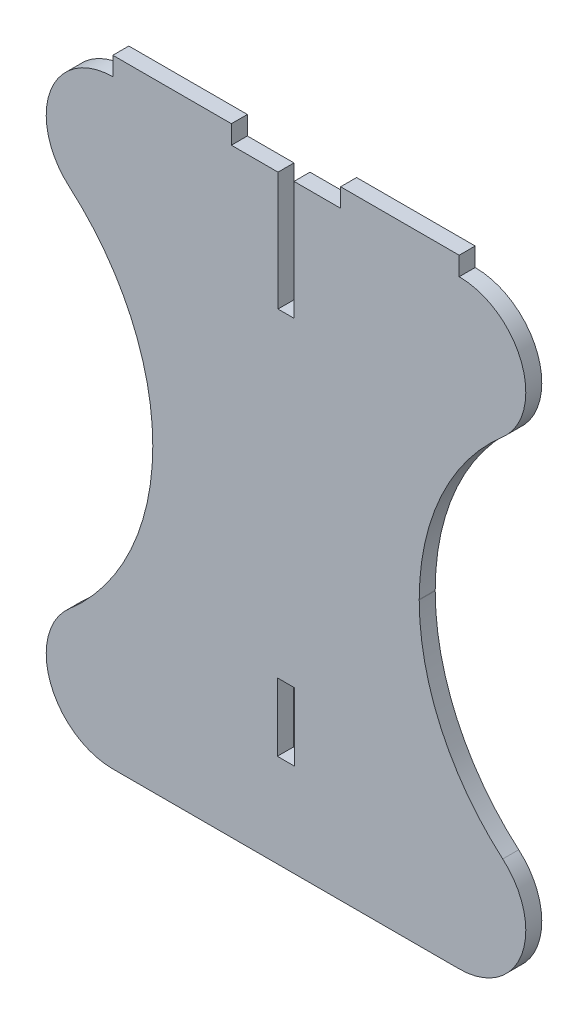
ISO-10303-21;
HEADER;
FILE_DESCRIPTION(('STEP AP214'),'2;1');
FILE_NAME('part.step','',(''),(''),'','','');
FILE_SCHEMA(('AUTOMOTIVE_DESIGN { 1 0 10303 214 1 1 1 1 }'));
ENDSEC;
DATA;
#1=APPLICATION_CONTEXT('core data for automotive mechanical design processes');
#2=APPLICATION_PROTOCOL_DEFINITION('international standard','automotive_design',2000,#1);
#3=PRODUCT_CONTEXT('',#1,'mechanical');
#4=PRODUCT('Part','Part','',(#3));
#5=PRODUCT_RELATED_PRODUCT_CATEGORY('part','',(#4));
#6=PRODUCT_DEFINITION_FORMATION('','',#4);
#7=PRODUCT_DEFINITION_CONTEXT('part definition',#1,'design');
#8=PRODUCT_DEFINITION('design','',#6,#7);
#9=PRODUCT_DEFINITION_SHAPE('','',#8);
#10=(LENGTH_UNIT() NAMED_UNIT(*) SI_UNIT(.MILLI.,.METRE.));
#11=(NAMED_UNIT(*) PLANE_ANGLE_UNIT() SI_UNIT($,.RADIAN.));
#12=(NAMED_UNIT(*) SI_UNIT($,.STERADIAN.) SOLID_ANGLE_UNIT());
#13=UNCERTAINTY_MEASURE_WITH_UNIT(LENGTH_MEASURE(1.E-05),#10,'distance_accuracy_value','');
#14=(GEOMETRIC_REPRESENTATION_CONTEXT(3) GLOBAL_UNCERTAINTY_ASSIGNED_CONTEXT((#13)) GLOBAL_UNIT_ASSIGNED_CONTEXT((#10,
#11,#12)) REPRESENTATION_CONTEXT('',''));
#15=CARTESIAN_POINT('',(0.,0.,0.));
#16=DIRECTION('',(0.,0.,1.));
#17=DIRECTION('',(1.,0.,0.));
#18=AXIS2_PLACEMENT_3D('',#15,#16,#17);
#19=CARTESIAN_POINT('',(50.0000000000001,450.,12.));
#20=DIRECTION('',(0.,-1.,0.));
#21=DIRECTION('',(1.,0.,0.));
#22=AXIS2_PLACEMENT_3D('',#19,#20,#21);
#23=PLANE('',#22);
#24=DIRECTION('',(-1.,0.,0.));
#25=VECTOR('',#24,1.);
#26=CARTESIAN_POINT('',(50.0000000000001,450.,0.));
#27=LINE('',#26,#25);
#28=CARTESIAN_POINT('',(221.000000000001,450.000000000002,0.));
#29=VERTEX_POINT('',#28);
#30=CARTESIAN_POINT('',(186.,450.000000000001,0.));
#31=VERTEX_POINT('',#30);
#32=EDGE_CURVE('E357',#29,#31,#27,.T.);
#33=ORIENTED_EDGE('',*,*,#32,.T.);
#34=DIRECTION('',(0.,0.,1.));
#35=VECTOR('',#34,1.);
#36=CARTESIAN_POINT('',(186.,450.000000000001,0.));
#37=LINE('',#36,#35);
#38=CARTESIAN_POINT('',(186.,450.000000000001,12.));
#39=VERTEX_POINT('',#38);
#40=EDGE_CURVE('E259',#31,#39,#37,.T.);
#41=ORIENTED_EDGE('',*,*,#40,.T.);
#42=DIRECTION('',(-1.,0.,0.));
#43=VECTOR('',#42,1.);
#44=CARTESIAN_POINT('',(50.0000000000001,450.,12.));
#45=LINE('',#44,#43);
#46=CARTESIAN_POINT('',(221.000000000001,450.000000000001,12.));
#47=VERTEX_POINT('',#46);
#48=EDGE_CURVE('E335',#47,#39,#45,.T.);
#49=ORIENTED_EDGE('',*,*,#48,.F.);
#50=DIRECTION('',(0.,0.,1.));
#51=VECTOR('',#50,1.);
#52=CARTESIAN_POINT('',(221.000000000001,450.000000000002,0.));
#53=LINE('',#52,#51);
#54=EDGE_CURVE('E286',#29,#47,#53,.T.);
#55=ORIENTED_EDGE('',*,*,#54,.F.);
#56=EDGE_LOOP('',(#33,#41,#49,#55));
#57=FACE_BOUND('',#56,.T.);
#58=ADVANCED_FACE('F33',(#57),#23,.F.);
#59=CARTESIAN_POINT('',(80.0000000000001,350.,12.));
#60=DIRECTION('',(1.,0.,0.));
#61=DIRECTION('',(0.,1.,0.));
#62=AXIS2_PLACEMENT_3D('',#59,#60,#61);
#63=PLANE('',#62);
#64=DIRECTION('',(0.,-1.,0.));
#65=VECTOR('',#64,1.);
#66=CARTESIAN_POINT('',(80.0000000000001,350.,0.));
#67=LINE('',#66,#65);
#68=CARTESIAN_POINT('',(80.0000000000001,225.185812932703,0.));
#69=VERTEX_POINT('',#68);
#70=CARTESIAN_POINT('',(80.0000000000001,224.81418706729,0.));
#71=VERTEX_POINT('',#70);
#72=EDGE_CURVE('E313',#69,#71,#67,.T.);
#73=ORIENTED_EDGE('',*,*,#72,.T.);
#74=DIRECTION('',(0.,0.,1.));
#75=VECTOR('',#74,1.);
#76=CARTESIAN_POINT('',(80.0000000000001,224.81418706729,12.));
#77=LINE('',#76,#75);
#78=CARTESIAN_POINT('',(80.0000000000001,224.81418706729,12.));
#79=VERTEX_POINT('',#78);
#80=EDGE_CURVE('E379',#71,#79,#77,.T.);
#81=ORIENTED_EDGE('',*,*,#80,.T.);
#82=DIRECTION('',(0.,-1.,0.));
#83=VECTOR('',#82,1.);
#84=CARTESIAN_POINT('',(80.0000000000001,350.,12.));
#85=LINE('',#84,#83);
#86=CARTESIAN_POINT('',(80.0000000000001,225.185812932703,12.));
#87=VERTEX_POINT('',#86);
#88=EDGE_CURVE('E318',#87,#79,#85,.T.);
#89=ORIENTED_EDGE('',*,*,#88,.F.);
#90=DIRECTION('',(0.,0.,1.));
#91=VECTOR('',#90,1.);
#92=CARTESIAN_POINT('',(80.0000000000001,225.185812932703,0.));
#93=LINE('',#92,#91);
#94=EDGE_CURVE('E376',#87,#69,#93,.F.);
#95=ORIENTED_EDGE('',*,*,#94,.T.);
#96=EDGE_LOOP('',(#73,#81,#89,#95));
#97=FACE_BOUND('',#96,.T.);
#98=ADVANCED_FACE('F419',(#97),#63,.F.);
#99=CARTESIAN_POINT('',(50.0000000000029,49.999999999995,12.));
#100=DIRECTION('',(0.,0.,-1.));
#101=DIRECTION('',(-1.,0.,0.));
#102=AXIS2_PLACEMENT_3D('',#99,#100,#101);
#103=CYLINDRICAL_SURFACE('',#102,50.);
#104=CARTESIAN_POINT('',(50.0000000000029,49.999999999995,12.));
#105=DIRECTION('',(0.,0.,1.));
#106=DIRECTION('',(-1.,0.,0.));
#107=AXIS2_PLACEMENT_3D('',#104,#105,#106);
#108=CIRCLE('',#107,50.);
#109=CARTESIAN_POINT('',(17.3160173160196,87.8385686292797,12.));
#110=VERTEX_POINT('',#109);
#111=CARTESIAN_POINT('',(50.0000000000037,-4.96824803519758E-12,12.));
#112=VERTEX_POINT('',#111);
#113=EDGE_CURVE('E321',#110,#112,#108,.T.);
#114=ORIENTED_EDGE('',*,*,#113,.F.);
#115=DIRECTION('',(0.,0.,-1.));
#116=VECTOR('',#115,1.);
#117=CARTESIAN_POINT('',(17.3160173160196,87.8385686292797,12.));
#118=LINE('',#117,#116);
#119=CARTESIAN_POINT('',(17.3160173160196,87.8385686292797,0.));
#120=VERTEX_POINT('',#119);
#121=EDGE_CURVE('E373',#110,#120,#118,.T.);
#122=ORIENTED_EDGE('',*,*,#121,.T.);
#123=CARTESIAN_POINT('',(50.0000000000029,49.999999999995,0.));
#124=DIRECTION('',(0.,0.,1.));
#125=DIRECTION('',(-1.,0.,0.));
#126=AXIS2_PLACEMENT_3D('',#123,#124,#125);
#127=CIRCLE('',#126,50.);
#128=CARTESIAN_POINT('',(50.0000000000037,-4.96824803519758E-12,0.));
#129=VERTEX_POINT('',#128);
#130=EDGE_CURVE('E344',#120,#129,#127,.T.);
#131=ORIENTED_EDGE('',*,*,#130,.T.);
#132=DIRECTION('',(0.,0.,-1.));
#133=VECTOR('',#132,1.);
#134=CARTESIAN_POINT('',(50.0000000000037,-4.96824803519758E-12,12.));
#135=LINE('',#134,#133);
#136=EDGE_CURVE('E370',#112,#129,#135,.T.);
#137=ORIENTED_EDGE('',*,*,#136,.F.);
#138=EDGE_LOOP('',(#114,#122,#131,#137));
#139=FACE_BOUND('',#138,.T.);
#140=ADVANCED_FACE('F427',(#139),#103,.T.);
#141=CARTESIAN_POINT('',(310.000000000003,-2.77555756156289E-12,12.));
#142=DIRECTION('',(0.,1.,0.));
#143=DIRECTION('',(-1.,0.,0.));
#144=AXIS2_PLACEMENT_3D('',#141,#142,#143);
#145=PLANE('',#144);
#146=DIRECTION('',(1.,0.,0.));
#147=VECTOR('',#146,1.);
#148=CARTESIAN_POINT('',(310.000000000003,-2.77555756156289E-12,0.));
#149=LINE('',#148,#147);
#150=CARTESIAN_POINT('',(310.000000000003,-2.77555756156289E-12,0.));
#151=VERTEX_POINT('',#150);
#152=EDGE_CURVE('E346',#129,#151,#149,.T.);
#153=ORIENTED_EDGE('',*,*,#152,.T.);
#154=DIRECTION('',(0.,0.,-1.));
#155=VECTOR('',#154,1.);
#156=CARTESIAN_POINT('',(310.000000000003,-2.77555756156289E-12,12.));
#157=LINE('',#156,#155);
#158=CARTESIAN_POINT('',(310.000000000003,-2.77555756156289E-12,12.));
#159=VERTEX_POINT('',#158);
#160=EDGE_CURVE('E367',#159,#151,#157,.T.);
#161=ORIENTED_EDGE('',*,*,#160,.F.);
#162=DIRECTION('',(1.,0.,0.));
#163=VECTOR('',#162,1.);
#164=CARTESIAN_POINT('',(310.000000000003,-2.77555756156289E-12,12.));
#165=LINE('',#164,#163);
#166=EDGE_CURVE('E324',#112,#159,#165,.T.);
#167=ORIENTED_EDGE('',*,*,#166,.F.);
#168=ORIENTED_EDGE('',*,*,#136,.T.);
#169=EDGE_LOOP('',(#153,#161,#167,#168));
#170=FACE_BOUND('',#169,.T.);
#171=ADVANCED_FACE('F433',(#170),#145,.F.);
#172=CARTESIAN_POINT('',(310.000000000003,49.9999999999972,12.));
#173=DIRECTION('',(0.,0.,-1.));
#174=DIRECTION('',(-1.,0.,0.));
#175=AXIS2_PLACEMENT_3D('',#172,#173,#174);
#176=CYLINDRICAL_SURFACE('',#175,50.);
#177=CARTESIAN_POINT('',(310.000000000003,49.9999999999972,0.));
#178=DIRECTION('',(0.,0.,1.));
#179=DIRECTION('',(1.,0.,0.));
#180=AXIS2_PLACEMENT_3D('',#177,#178,#179);
#181=CIRCLE('',#180,50.);
#182=CARTESIAN_POINT('',(342.683982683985,87.838568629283,0.));
#183=VERTEX_POINT('',#182);
#184=EDGE_CURVE('E348',#151,#183,#181,.T.);
#185=ORIENTED_EDGE('',*,*,#184,.T.);
#186=DIRECTION('',(0.,0.,-1.));
#187=VECTOR('',#186,1.);
#188=CARTESIAN_POINT('',(342.683982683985,87.8385686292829,12.));
#189=LINE('',#188,#187);
#190=CARTESIAN_POINT('',(342.683982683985,87.838568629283,12.));
#191=VERTEX_POINT('',#190);
#192=EDGE_CURVE('E386',#183,#191,#189,.F.);
#193=ORIENTED_EDGE('',*,*,#192,.T.);
#194=CARTESIAN_POINT('',(310.000000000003,49.9999999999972,12.));
#195=DIRECTION('',(0.,0.,1.));
#196=DIRECTION('',(1.,0.,0.));
#197=AXIS2_PLACEMENT_3D('',#194,#195,#196);
#198=CIRCLE('',#197,50.);
#199=EDGE_CURVE('E326',#159,#191,#198,.T.);
#200=ORIENTED_EDGE('',*,*,#199,.F.);
#201=ORIENTED_EDGE('',*,*,#160,.T.);
#202=EDGE_LOOP('',(#185,#193,#200,#201));
#203=FACE_BOUND('',#202,.T.);
#204=ADVANCED_FACE('F521',(#203),#176,.T.);
#205=CARTESIAN_POINT('',(280.,350.,12.));
#206=DIRECTION('',(-1.,0.,0.));
#207=DIRECTION('',(0.,0.,1.));
#208=AXIS2_PLACEMENT_3D('',#205,#206,#207);
#209=PLANE('',#208);
#210=DIRECTION('',(0.,1.,0.));
#211=VECTOR('',#210,1.);
#212=CARTESIAN_POINT('',(280.,350.,12.));
#213=LINE('',#212,#211);
#214=CARTESIAN_POINT('',(280.,224.814187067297,12.));
#215=VERTEX_POINT('',#214);
#216=CARTESIAN_POINT('',(280.,225.185812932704,12.));
#217=VERTEX_POINT('',#216);
#218=EDGE_CURVE('E329',#215,#217,#213,.T.);
#219=ORIENTED_EDGE('',*,*,#218,.F.);
#220=DIRECTION('',(0.,0.,1.));
#221=VECTOR('',#220,1.);
#222=CARTESIAN_POINT('',(280.,224.814187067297,0.));
#223=LINE('',#222,#221);
#224=CARTESIAN_POINT('',(280.,224.814187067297,0.));
#225=VERTEX_POINT('',#224);
#226=EDGE_CURVE('E383',#215,#225,#223,.F.);
#227=ORIENTED_EDGE('',*,*,#226,.T.);
#228=DIRECTION('',(0.,1.,0.));
#229=VECTOR('',#228,1.);
#230=CARTESIAN_POINT('',(280.,350.,0.));
#231=LINE('',#230,#229);
#232=CARTESIAN_POINT('',(280.,225.185812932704,0.));
#233=VERTEX_POINT('',#232);
#234=EDGE_CURVE('E351',#225,#233,#231,.T.);
#235=ORIENTED_EDGE('',*,*,#234,.T.);
#236=DIRECTION('',(0.,0.,1.));
#237=VECTOR('',#236,1.);
#238=CARTESIAN_POINT('',(280.,225.185812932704,12.));
#239=LINE('',#238,#237);
#240=EDGE_CURVE('E381',#233,#217,#239,.T.);
#241=ORIENTED_EDGE('',*,*,#240,.T.);
#242=EDGE_LOOP('',(#219,#227,#235,#241));
#243=FACE_BOUND('',#242,.T.);
#244=ADVANCED_FACE('F444',(#243),#209,.F.);
#245=CARTESIAN_POINT('',(310.000000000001,400.000000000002,12.));
#246=DIRECTION('',(0.,0.,-1.));
#247=DIRECTION('',(-1.,0.,0.));
#248=AXIS2_PLACEMENT_3D('',#245,#246,#247);
#249=CYLINDRICAL_SURFACE('',#248,50.);
#250=CARTESIAN_POINT('',(310.000000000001,400.000000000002,12.));
#251=DIRECTION('',(0.,0.,1.));
#252=DIRECTION('',(-1.,0.,0.));
#253=AXIS2_PLACEMENT_3D('',#250,#251,#252);
#254=CIRCLE('',#253,50.);
#255=CARTESIAN_POINT('',(342.683982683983,362.161431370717,12.));
#256=VERTEX_POINT('',#255);
#257=CARTESIAN_POINT('',(310.,450.000000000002,12.));
#258=VERTEX_POINT('',#257);
#259=EDGE_CURVE('E332',#256,#258,#254,.T.);
#260=ORIENTED_EDGE('',*,*,#259,.F.);
#261=DIRECTION('',(0.,0.,-1.));
#262=VECTOR('',#261,1.);
#263=CARTESIAN_POINT('',(342.683982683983,362.161431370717,12.));
#264=LINE('',#263,#262);
#265=CARTESIAN_POINT('',(342.683982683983,362.161431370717,0.));
#266=VERTEX_POINT('',#265);
#267=EDGE_CURVE('E388',#256,#266,#264,.T.);
#268=ORIENTED_EDGE('',*,*,#267,.T.);
#269=CARTESIAN_POINT('',(310.000000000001,400.000000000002,0.));
#270=DIRECTION('',(0.,0.,1.));
#271=DIRECTION('',(-1.,0.,0.));
#272=AXIS2_PLACEMENT_3D('',#269,#270,#271);
#273=CIRCLE('',#272,50.);
#274=CARTESIAN_POINT('',(310.,450.000000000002,0.));
#275=VERTEX_POINT('',#274);
#276=EDGE_CURVE('E354',#266,#275,#273,.T.);
#277=ORIENTED_EDGE('',*,*,#276,.T.);
#278=DIRECTION('',(0.,0.,-1.));
#279=VECTOR('',#278,1.);
#280=CARTESIAN_POINT('',(310.,450.000000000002,12.));
#281=LINE('',#280,#279);
#282=EDGE_CURVE('E364',#258,#275,#281,.T.);
#283=ORIENTED_EDGE('',*,*,#282,.F.);
#284=EDGE_LOOP('',(#260,#268,#277,#283));
#285=FACE_BOUND('',#284,.T.);
#286=ADVANCED_FACE('F455',(#285),#249,.T.);
#287=CARTESIAN_POINT('',(174.,450.000000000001,12.));
#288=VERTEX_POINT('',#287);
#289=CARTESIAN_POINT('',(139.,450.000000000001,12.));
#290=VERTEX_POINT('',#289);
#291=EDGE_CURVE('E334',#288,#290,#45,.T.);
#292=ORIENTED_EDGE('',*,*,#291,.F.);
#293=DIRECTION('',(0.,0.,1.));
#294=VECTOR('',#293,1.);
#295=CARTESIAN_POINT('',(174.,450.000000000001,0.));
#296=LINE('',#295,#294);
#297=CARTESIAN_POINT('',(174.,450.000000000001,0.));
#298=VERTEX_POINT('',#297);
#299=EDGE_CURVE('E252',#298,#288,#296,.T.);
#300=ORIENTED_EDGE('',*,*,#299,.F.);
#301=CARTESIAN_POINT('',(139.,450.000000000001,0.));
#302=VERTEX_POINT('',#301);
#303=EDGE_CURVE('E356',#298,#302,#27,.T.);
#304=ORIENTED_EDGE('',*,*,#303,.T.);
#305=DIRECTION('',(0.,0.,1.));
#306=VECTOR('',#305,1.);
#307=CARTESIAN_POINT('',(139.,450.000000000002,0.));
#308=LINE('',#307,#306);
#309=EDGE_CURVE('E303',#302,#290,#308,.T.);
#310=ORIENTED_EDGE('',*,*,#309,.T.);
#311=EDGE_LOOP('',(#292,#300,#304,#310));
#312=FACE_BOUND('',#311,.T.);
#313=ADVANCED_FACE('F484',(#312),#23,.F.);
#314=CARTESIAN_POINT('',(50.0000000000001,400.,12.));
#315=DIRECTION('',(0.,0.,-1.));
#316=DIRECTION('',(-1.,0.,0.));
#317=AXIS2_PLACEMENT_3D('',#314,#315,#316);
#318=CYLINDRICAL_SURFACE('',#317,50.);
#319=CARTESIAN_POINT('',(50.0000000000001,400.,0.));
#320=DIRECTION('',(0.,0.,1.));
#321=DIRECTION('',(1.,0.,0.));
#322=AXIS2_PLACEMENT_3D('',#319,#320,#321);
#323=CIRCLE('',#322,50.);
#324=CARTESIAN_POINT('',(50.0000000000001,450.,0.));
#325=VERTEX_POINT('',#324);
#326=CARTESIAN_POINT('',(17.3160173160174,362.161431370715,0.));
#327=VERTEX_POINT('',#326);
#328=EDGE_CURVE('E322',#325,#327,#323,.T.);
#329=ORIENTED_EDGE('',*,*,#328,.T.);
#330=DIRECTION('',(0.,0.,-1.));
#331=VECTOR('',#330,1.);
#332=CARTESIAN_POINT('',(17.3160173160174,362.161431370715,12.));
#333=LINE('',#332,#331);
#334=CARTESIAN_POINT('',(17.3160173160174,362.161431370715,12.));
#335=VERTEX_POINT('',#334);
#336=EDGE_CURVE('E391',#327,#335,#333,.F.);
#337=ORIENTED_EDGE('',*,*,#336,.T.);
#338=CARTESIAN_POINT('',(50.0000000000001,400.,12.));
#339=DIRECTION('',(0.,0.,1.));
#340=DIRECTION('',(1.,0.,0.));
#341=AXIS2_PLACEMENT_3D('',#338,#339,#340);
#342=CIRCLE('',#341,50.);
#343=CARTESIAN_POINT('',(50.0000000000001,450.,12.));
#344=VERTEX_POINT('',#343);
#345=EDGE_CURVE('E338',#344,#335,#342,.T.);
#346=ORIENTED_EDGE('',*,*,#345,.F.);
#347=DIRECTION('',(0.,0.,-1.));
#348=VECTOR('',#347,1.);
#349=CARTESIAN_POINT('',(50.0000000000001,450.,12.));
#350=LINE('',#349,#348);
#351=EDGE_CURVE('E341',#344,#325,#350,.T.);
#352=ORIENTED_EDGE('',*,*,#351,.T.);
#353=EDGE_LOOP('',(#329,#337,#346,#352));
#354=FACE_BOUND('',#353,.T.);
#355=ADVANCED_FACE('F410',(#354),#318,.T.);
#356=CARTESIAN_POINT('',(50.0000000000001,400.,12.));
#357=DIRECTION('',(0.,0.,1.));
#358=DIRECTION('',(1.,0.,0.));
#359=AXIS2_PLACEMENT_3D('',#356,#357,#358);
#360=PLANE('',#359);
#361=DIRECTION('',(0.,-1.,0.));
#362=VECTOR('',#361,1.);
#363=CARTESIAN_POINT('',(173.5,70.,12.));
#364=LINE('',#363,#362);
#365=CARTESIAN_POINT('',(173.5,121.,12.));
#366=VERTEX_POINT('',#365);
#367=CARTESIAN_POINT('',(173.5,70.0000000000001,12.));
#368=VERTEX_POINT('',#367);
#369=EDGE_CURVE('E48',#366,#368,#364,.T.);
#370=ORIENTED_EDGE('',*,*,#369,.F.);
#371=DIRECTION('',(-1.,0.,0.));
#372=VECTOR('',#371,1.);
#373=CARTESIAN_POINT('',(173.5,121.,12.));
#374=LINE('',#373,#372);
#375=CARTESIAN_POINT('',(186.5,121.,12.));
#376=VERTEX_POINT('',#375);
#377=EDGE_CURVE('E223',#376,#366,#374,.T.);
#378=ORIENTED_EDGE('',*,*,#377,.F.);
#379=DIRECTION('',(0.,1.,0.));
#380=VECTOR('',#379,1.);
#381=CARTESIAN_POINT('',(186.5,121.,12.));
#382=LINE('',#381,#380);
#383=CARTESIAN_POINT('',(186.5,70.,12.));
#384=VERTEX_POINT('',#383);
#385=EDGE_CURVE('E226',#384,#376,#382,.T.);
#386=ORIENTED_EDGE('',*,*,#385,.F.);
#387=DIRECTION('',(1.,0.,0.));
#388=VECTOR('',#387,1.);
#389=CARTESIAN_POINT('',(186.5,70.,12.));
#390=LINE('',#389,#388);
#391=EDGE_CURVE('E232',#368,#384,#390,.T.);
#392=ORIENTED_EDGE('',*,*,#391,.F.);
#393=EDGE_LOOP('',(#370,#378,#386,#392));
#394=FACE_BOUND('',#393,.T.);
#395=DIRECTION('',(0.,1.,0.));
#396=VECTOR('',#395,1.);
#397=CARTESIAN_POINT('',(186.,361.000000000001,12.));
#398=LINE('',#397,#396);
#399=CARTESIAN_POINT('',(186.,361.000000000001,12.));
#400=VERTEX_POINT('',#399);
#401=EDGE_CURVE('E246',#400,#39,#398,.T.);
#402=ORIENTED_EDGE('',*,*,#401,.F.);
#403=DIRECTION('',(1.,0.,0.));
#404=VECTOR('',#403,1.);
#405=CARTESIAN_POINT('',(174.,361.000000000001,12.));
#406=LINE('',#405,#404);
#407=CARTESIAN_POINT('',(174.,361.000000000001,12.));
#408=VERTEX_POINT('',#407);
#409=EDGE_CURVE('E255',#408,#400,#406,.T.);
#410=ORIENTED_EDGE('',*,*,#409,.F.);
#411=DIRECTION('',(0.,-1.,0.));
#412=VECTOR('',#411,1.);
#413=CARTESIAN_POINT('',(174.,450.000000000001,12.));
#414=LINE('',#413,#412);
#415=EDGE_CURVE('E238',#288,#408,#414,.T.);
#416=ORIENTED_EDGE('',*,*,#415,.F.);
#417=ORIENTED_EDGE('',*,*,#291,.T.);
#418=DIRECTION('',(0.,1.,0.));
#419=VECTOR('',#418,1.);
#420=CARTESIAN_POINT('',(139.,464.000000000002,12.));
#421=LINE('',#420,#419);
#422=CARTESIAN_POINT('',(139.,464.000000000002,12.));
#423=VERTEX_POINT('',#422);
#424=EDGE_CURVE('E289',#290,#423,#421,.T.);
#425=ORIENTED_EDGE('',*,*,#424,.T.);
#426=DIRECTION('',(-1.,0.,0.));
#427=VECTOR('',#426,1.);
#428=CARTESIAN_POINT('',(50.0000000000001,464.000000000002,12.));
#429=LINE('',#428,#427);
#430=CARTESIAN_POINT('',(50.0000000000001,464.000000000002,12.));
#431=VERTEX_POINT('',#430);
#432=EDGE_CURVE('E306',#423,#431,#429,.T.);
#433=ORIENTED_EDGE('',*,*,#432,.T.);
#434=DIRECTION('',(0.,-1.,0.));
#435=VECTOR('',#434,1.);
#436=CARTESIAN_POINT('',(50.0000000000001,450.,12.));
#437=LINE('',#436,#435);
#438=EDGE_CURVE('E297',#431,#344,#437,.T.);
#439=ORIENTED_EDGE('',*,*,#438,.T.);
#440=ORIENTED_EDGE('',*,*,#345,.T.);
#441=CARTESIAN_POINT('',(-101.,225.185812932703,12.));
#442=DIRECTION('',(0.,0.,1.));
#443=DIRECTION('',(1.,0.,0.));
#444=AXIS2_PLACEMENT_3D('',#441,#442,#443);
#445=CIRCLE('',#444,181.);
#446=EDGE_CURVE('E11',#335,#87,#445,.F.);
#447=ORIENTED_EDGE('',*,*,#446,.T.);
#448=ORIENTED_EDGE('',*,*,#88,.T.);
#449=CARTESIAN_POINT('',(-101.,224.81418706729,12.));
#450=DIRECTION('',(0.,0.,1.));
#451=DIRECTION('',(1.,0.,0.));
#452=AXIS2_PLACEMENT_3D('',#449,#450,#451);
#453=CIRCLE('',#452,181.);
#454=EDGE_CURVE('E395',#79,#110,#453,.F.);
#455=ORIENTED_EDGE('',*,*,#454,.T.);
#456=ORIENTED_EDGE('',*,*,#113,.T.);
#457=ORIENTED_EDGE('',*,*,#166,.T.);
#458=ORIENTED_EDGE('',*,*,#199,.T.);
#459=CARTESIAN_POINT('',(461.,224.814187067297,12.));
#460=DIRECTION('',(0.,0.,1.));
#461=DIRECTION('',(1.,0.,0.));
#462=AXIS2_PLACEMENT_3D('',#459,#460,#461);
#463=CIRCLE('',#462,181.);
#464=EDGE_CURVE('E399',#191,#215,#463,.F.);
#465=ORIENTED_EDGE('',*,*,#464,.T.);
#466=ORIENTED_EDGE('',*,*,#218,.T.);
#467=CARTESIAN_POINT('',(461.,225.185812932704,12.));
#468=DIRECTION('',(0.,0.,1.));
#469=DIRECTION('',(1.,0.,0.));
#470=AXIS2_PLACEMENT_3D('',#467,#468,#469);
#471=CIRCLE('',#470,181.);
#472=EDGE_CURVE('E403',#217,#256,#471,.F.);
#473=ORIENTED_EDGE('',*,*,#472,.T.);
#474=ORIENTED_EDGE('',*,*,#259,.T.);
#475=DIRECTION('',(0.,1.,0.));
#476=VECTOR('',#475,1.);
#477=CARTESIAN_POINT('',(310.,450.000000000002,12.));
#478=LINE('',#477,#476);
#479=CARTESIAN_POINT('',(310.000000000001,464.000000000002,12.));
#480=VERTEX_POINT('',#479);
#481=EDGE_CURVE('E262',#258,#480,#478,.T.);
#482=ORIENTED_EDGE('',*,*,#481,.T.);
#483=DIRECTION('',(-1.,0.,0.));
#484=VECTOR('',#483,1.);
#485=CARTESIAN_POINT('',(310.000000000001,464.000000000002,12.));
#486=LINE('',#485,#484);
#487=CARTESIAN_POINT('',(221.000000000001,464.000000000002,12.));
#488=VERTEX_POINT('',#487);
#489=EDGE_CURVE('E281',#480,#488,#486,.T.);
#490=ORIENTED_EDGE('',*,*,#489,.T.);
#491=DIRECTION('',(0.,-1.,0.));
#492=VECTOR('',#491,1.);
#493=CARTESIAN_POINT('',(221.000000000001,464.000000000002,12.));
#494=LINE('',#493,#492);
#495=EDGE_CURVE('E272',#488,#47,#494,.T.);
#496=ORIENTED_EDGE('',*,*,#495,.T.);
#497=ORIENTED_EDGE('',*,*,#48,.T.);
#498=EDGE_LOOP('',(#402,#410,#416,#417,#425,#433,#439,#440,#447,#448,#455,#456,#457,#458,#465,
#466,#473,#474,#482,#490,#496,#497));
#499=FACE_BOUND('',#498,.T.);
#500=ADVANCED_FACE('F416',(#394,#499),#360,.T.);
#501=CARTESIAN_POINT('',(50.0000000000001,400.,0.));
#502=DIRECTION('',(0.,0.,1.));
#503=DIRECTION('',(1.,0.,0.));
#504=AXIS2_PLACEMENT_3D('',#501,#502,#503);
#505=PLANE('',#504);
#506=DIRECTION('',(-1.,0.,0.));
#507=VECTOR('',#506,1.);
#508=CARTESIAN_POINT('',(173.5,121.,0.));
#509=LINE('',#508,#507);
#510=CARTESIAN_POINT('',(186.5,121.,0.));
#511=VERTEX_POINT('',#510);
#512=CARTESIAN_POINT('',(173.5,121.,0.));
#513=VERTEX_POINT('',#512);
#514=EDGE_CURVE('E213',#511,#513,#509,.T.);
#515=ORIENTED_EDGE('',*,*,#514,.T.);
#516=DIRECTION('',(0.,-1.,0.));
#517=VECTOR('',#516,1.);
#518=CARTESIAN_POINT('',(173.5,70.,0.));
#519=LINE('',#518,#517);
#520=CARTESIAN_POINT('',(173.5,70.,0.));
#521=VERTEX_POINT('',#520);
#522=EDGE_CURVE('E207',#513,#521,#519,.T.);
#523=ORIENTED_EDGE('',*,*,#522,.T.);
#524=DIRECTION('',(1.,0.,0.));
#525=VECTOR('',#524,1.);
#526=CARTESIAN_POINT('',(186.5,70.,0.));
#527=LINE('',#526,#525);
#528=CARTESIAN_POINT('',(186.5,70.0000000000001,0.));
#529=VERTEX_POINT('',#528);
#530=EDGE_CURVE('E216',#521,#529,#527,.T.);
#531=ORIENTED_EDGE('',*,*,#530,.T.);
#532=DIRECTION('',(0.,1.,0.));
#533=VECTOR('',#532,1.);
#534=CARTESIAN_POINT('',(186.5,121.,0.));
#535=LINE('',#534,#533);
#536=EDGE_CURVE('E56',#529,#511,#535,.T.);
#537=ORIENTED_EDGE('',*,*,#536,.T.);
#538=EDGE_LOOP('',(#515,#523,#531,#537));
#539=FACE_BOUND('',#538,.T.);
#540=DIRECTION('',(1.,0.,0.));
#541=VECTOR('',#540,1.);
#542=CARTESIAN_POINT('',(174.,361.000000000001,0.));
#543=LINE('',#542,#541);
#544=CARTESIAN_POINT('',(174.,361.000000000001,0.));
#545=VERTEX_POINT('',#544);
#546=CARTESIAN_POINT('',(186.,361.000000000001,0.));
#547=VERTEX_POINT('',#546);
#548=EDGE_CURVE('E245',#545,#547,#543,.T.);
#549=ORIENTED_EDGE('',*,*,#548,.T.);
#550=DIRECTION('',(0.,1.,0.));
#551=VECTOR('',#550,1.);
#552=CARTESIAN_POINT('',(186.,361.000000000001,0.));
#553=LINE('',#552,#551);
#554=EDGE_CURVE('E249',#547,#31,#553,.T.);
#555=ORIENTED_EDGE('',*,*,#554,.T.);
#556=ORIENTED_EDGE('',*,*,#32,.F.);
#557=DIRECTION('',(0.,-1.,0.));
#558=VECTOR('',#557,1.);
#559=CARTESIAN_POINT('',(221.000000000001,464.000000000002,0.));
#560=LINE('',#559,#558);
#561=CARTESIAN_POINT('',(221.000000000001,464.000000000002,0.));
#562=VERTEX_POINT('',#561);
#563=EDGE_CURVE('E275',#562,#29,#560,.T.);
#564=ORIENTED_EDGE('',*,*,#563,.F.);
#565=DIRECTION('',(-1.,0.,0.));
#566=VECTOR('',#565,1.);
#567=CARTESIAN_POINT('',(310.000000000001,464.000000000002,0.));
#568=LINE('',#567,#566);
#569=CARTESIAN_POINT('',(310.000000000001,464.000000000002,0.));
#570=VERTEX_POINT('',#569);
#571=EDGE_CURVE('E271',#570,#562,#568,.T.);
#572=ORIENTED_EDGE('',*,*,#571,.F.);
#573=DIRECTION('',(0.,1.,0.));
#574=VECTOR('',#573,1.);
#575=CARTESIAN_POINT('',(310.,450.000000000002,0.));
#576=LINE('',#575,#574);
#577=EDGE_CURVE('E268',#275,#570,#576,.T.);
#578=ORIENTED_EDGE('',*,*,#577,.F.);
#579=ORIENTED_EDGE('',*,*,#276,.F.);
#580=CARTESIAN_POINT('',(461.,225.185812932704,0.));
#581=DIRECTION('',(0.,0.,1.));
#582=DIRECTION('',(1.,0.,0.));
#583=AXIS2_PLACEMENT_3D('',#580,#581,#582);
#584=CIRCLE('',#583,181.);
#585=EDGE_CURVE('E401',#266,#233,#584,.T.);
#586=ORIENTED_EDGE('',*,*,#585,.T.);
#587=ORIENTED_EDGE('',*,*,#234,.F.);
#588=CARTESIAN_POINT('',(461.,224.814187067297,0.));
#589=DIRECTION('',(0.,0.,1.));
#590=DIRECTION('',(1.,0.,0.));
#591=AXIS2_PLACEMENT_3D('',#588,#589,#590);
#592=CIRCLE('',#591,181.);
#593=EDGE_CURVE('E397',#225,#183,#592,.T.);
#594=ORIENTED_EDGE('',*,*,#593,.T.);
#595=ORIENTED_EDGE('',*,*,#184,.F.);
#596=ORIENTED_EDGE('',*,*,#152,.F.);
#597=ORIENTED_EDGE('',*,*,#130,.F.);
#598=CARTESIAN_POINT('',(-101.,224.81418706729,0.));
#599=DIRECTION('',(0.,0.,1.));
#600=DIRECTION('',(1.,0.,0.));
#601=AXIS2_PLACEMENT_3D('',#598,#599,#600);
#602=CIRCLE('',#601,181.);
#603=EDGE_CURVE('E393',#120,#71,#602,.T.);
#604=ORIENTED_EDGE('',*,*,#603,.T.);
#605=ORIENTED_EDGE('',*,*,#72,.F.);
#606=CARTESIAN_POINT('',(-101.,225.185812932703,0.));
#607=DIRECTION('',(0.,0.,1.));
#608=DIRECTION('',(1.,0.,0.));
#609=AXIS2_PLACEMENT_3D('',#606,#607,#608);
#610=CIRCLE('',#609,181.);
#611=EDGE_CURVE('E41',#69,#327,#610,.T.);
#612=ORIENTED_EDGE('',*,*,#611,.T.);
#613=ORIENTED_EDGE('',*,*,#328,.F.);
#614=DIRECTION('',(0.,-1.,0.));
#615=VECTOR('',#614,1.);
#616=CARTESIAN_POINT('',(50.0000000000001,450.,0.));
#617=LINE('',#616,#615);
#618=CARTESIAN_POINT('',(50.0000000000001,464.000000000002,0.));
#619=VERTEX_POINT('',#618);
#620=EDGE_CURVE('E300',#619,#325,#617,.T.);
#621=ORIENTED_EDGE('',*,*,#620,.F.);
#622=DIRECTION('',(-1.,0.,0.));
#623=VECTOR('',#622,1.);
#624=CARTESIAN_POINT('',(50.0000000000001,464.000000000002,0.));
#625=LINE('',#624,#623);
#626=CARTESIAN_POINT('',(139.,464.000000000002,0.));
#627=VERTEX_POINT('',#626);
#628=EDGE_CURVE('E296',#627,#619,#625,.T.);
#629=ORIENTED_EDGE('',*,*,#628,.F.);
#630=DIRECTION('',(0.,1.,0.));
#631=VECTOR('',#630,1.);
#632=CARTESIAN_POINT('',(139.,464.000000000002,0.));
#633=LINE('',#632,#631);
#634=EDGE_CURVE('E293',#302,#627,#633,.T.);
#635=ORIENTED_EDGE('',*,*,#634,.F.);
#636=ORIENTED_EDGE('',*,*,#303,.F.);
#637=DIRECTION('',(0.,-1.,0.));
#638=VECTOR('',#637,1.);
#639=CARTESIAN_POINT('',(174.,450.000000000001,0.));
#640=LINE('',#639,#638);
#641=EDGE_CURVE('E242',#298,#545,#640,.T.);
#642=ORIENTED_EDGE('',*,*,#641,.T.);
#643=EDGE_LOOP('',(#549,#555,#556,#564,#572,#578,#579,#586,#587,#594,#595,#596,#597,#604,#605,
#612,#613,#621,#629,#635,#636,#642));
#644=FACE_BOUND('',#643,.T.);
#645=ADVANCED_FACE('F220',(#539,#644),#505,.F.);
#646=CARTESIAN_POINT('',(-101.,224.81418706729,12.));
#647=DIRECTION('',(0.,0.,-1.));
#648=DIRECTION('',(-1.,0.,0.));
#649=AXIS2_PLACEMENT_3D('',#646,#647,#648);
#650=CYLINDRICAL_SURFACE('',#649,181.);
#651=ORIENTED_EDGE('',*,*,#454,.F.);
#652=ORIENTED_EDGE('',*,*,#80,.F.);
#653=ORIENTED_EDGE('',*,*,#603,.F.);
#654=ORIENTED_EDGE('',*,*,#121,.F.);
#655=EDGE_LOOP('',(#651,#652,#653,#654));
#656=FACE_BOUND('',#655,.T.);
#657=ADVANCED_FACE('F422',(#656),#650,.F.);
#658=CARTESIAN_POINT('',(461.,224.814187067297,12.));
#659=DIRECTION('',(0.,0.,-1.));
#660=DIRECTION('',(-1.,0.,0.));
#661=AXIS2_PLACEMENT_3D('',#658,#659,#660);
#662=CYLINDRICAL_SURFACE('',#661,181.);
#663=ORIENTED_EDGE('',*,*,#464,.F.);
#664=ORIENTED_EDGE('',*,*,#192,.F.);
#665=ORIENTED_EDGE('',*,*,#593,.F.);
#666=ORIENTED_EDGE('',*,*,#226,.F.);
#667=EDGE_LOOP('',(#663,#664,#665,#666));
#668=FACE_BOUND('',#667,.T.);
#669=ADVANCED_FACE('F441',(#668),#662,.F.);
#670=CARTESIAN_POINT('',(461.,225.185812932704,12.));
#671=DIRECTION('',(0.,0.,-1.));
#672=DIRECTION('',(-1.,0.,0.));
#673=AXIS2_PLACEMENT_3D('',#670,#671,#672);
#674=CYLINDRICAL_SURFACE('',#673,181.);
#675=ORIENTED_EDGE('',*,*,#472,.F.);
#676=ORIENTED_EDGE('',*,*,#240,.F.);
#677=ORIENTED_EDGE('',*,*,#585,.F.);
#678=ORIENTED_EDGE('',*,*,#267,.F.);
#679=EDGE_LOOP('',(#675,#676,#677,#678));
#680=FACE_BOUND('',#679,.T.);
#681=ADVANCED_FACE('F452',(#680),#674,.F.);
#682=CARTESIAN_POINT('',(-101.,225.185812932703,12.));
#683=DIRECTION('',(0.,0.,-1.));
#684=DIRECTION('',(-1.,0.,0.));
#685=AXIS2_PLACEMENT_3D('',#682,#683,#684);
#686=CYLINDRICAL_SURFACE('',#685,181.);
#687=ORIENTED_EDGE('',*,*,#446,.F.);
#688=ORIENTED_EDGE('',*,*,#336,.F.);
#689=ORIENTED_EDGE('',*,*,#611,.F.);
#690=ORIENTED_EDGE('',*,*,#94,.F.);
#691=EDGE_LOOP('',(#687,#688,#689,#690));
#692=FACE_BOUND('',#691,.T.);
#693=ADVANCED_FACE('F35',(#692),#686,.F.);
#694=CARTESIAN_POINT('',(50.0000000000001,450.,0.));
#695=DIRECTION('',(-1.,0.,0.));
#696=DIRECTION('',(0.,0.,1.));
#697=AXIS2_PLACEMENT_3D('',#694,#695,#696);
#698=PLANE('',#697);
#699=ORIENTED_EDGE('',*,*,#438,.F.);
#700=DIRECTION('',(0.,0.,1.));
#701=VECTOR('',#700,1.);
#702=CARTESIAN_POINT('',(50.0000000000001,464.000000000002,0.));
#703=LINE('',#702,#701);
#704=EDGE_CURVE('E311',#619,#431,#703,.T.);
#705=ORIENTED_EDGE('',*,*,#704,.F.);
#706=ORIENTED_EDGE('',*,*,#620,.T.);
#707=ORIENTED_EDGE('',*,*,#351,.F.);
#708=EDGE_LOOP('',(#699,#705,#706,#707));
#709=FACE_BOUND('',#708,.T.);
#710=ADVANCED_FACE('F494',(#709),#698,.T.);
#711=CARTESIAN_POINT('',(50.0000000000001,464.000000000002,0.));
#712=DIRECTION('',(0.,1.,0.));
#713=DIRECTION('',(0.,0.,1.));
#714=AXIS2_PLACEMENT_3D('',#711,#712,#713);
#715=PLANE('',#714);
#716=ORIENTED_EDGE('',*,*,#432,.F.);
#717=DIRECTION('',(0.,0.,1.));
#718=VECTOR('',#717,1.);
#719=CARTESIAN_POINT('',(139.,464.000000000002,0.));
#720=LINE('',#719,#718);
#721=EDGE_CURVE('E314',#627,#423,#720,.T.);
#722=ORIENTED_EDGE('',*,*,#721,.F.);
#723=ORIENTED_EDGE('',*,*,#628,.T.);
#724=ORIENTED_EDGE('',*,*,#704,.T.);
#725=EDGE_LOOP('',(#716,#722,#723,#724));
#726=FACE_BOUND('',#725,.T.);
#727=ADVANCED_FACE('F496',(#726),#715,.T.);
#728=CARTESIAN_POINT('',(139.,464.000000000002,0.));
#729=DIRECTION('',(1.,0.,0.));
#730=DIRECTION('',(0.,0.,-1.));
#731=AXIS2_PLACEMENT_3D('',#728,#729,#730);
#732=PLANE('',#731);
#733=ORIENTED_EDGE('',*,*,#424,.F.);
#734=ORIENTED_EDGE('',*,*,#309,.F.);
#735=ORIENTED_EDGE('',*,*,#634,.T.);
#736=ORIENTED_EDGE('',*,*,#721,.T.);
#737=EDGE_LOOP('',(#733,#734,#735,#736));
#738=FACE_BOUND('',#737,.T.);
#739=ADVANCED_FACE('F489',(#738),#732,.T.);
#740=CARTESIAN_POINT('',(221.000000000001,464.000000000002,0.));
#741=DIRECTION('',(-1.,0.,0.));
#742=DIRECTION('',(0.,0.,1.));
#743=AXIS2_PLACEMENT_3D('',#740,#741,#742);
#744=PLANE('',#743);
#745=ORIENTED_EDGE('',*,*,#495,.F.);
#746=DIRECTION('',(0.,0.,1.));
#747=VECTOR('',#746,1.);
#748=CARTESIAN_POINT('',(221.000000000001,464.000000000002,0.));
#749=LINE('',#748,#747);
#750=EDGE_CURVE('E290',#562,#488,#749,.T.);
#751=ORIENTED_EDGE('',*,*,#750,.F.);
#752=ORIENTED_EDGE('',*,*,#563,.T.);
#753=ORIENTED_EDGE('',*,*,#54,.T.);
#754=EDGE_LOOP('',(#745,#751,#752,#753));
#755=FACE_BOUND('',#754,.T.);
#756=ADVANCED_FACE('F467',(#755),#744,.T.);
#757=CARTESIAN_POINT('',(310.000000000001,464.000000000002,0.));
#758=DIRECTION('',(0.,1.,0.));
#759=DIRECTION('',(0.,0.,1.));
#760=AXIS2_PLACEMENT_3D('',#757,#758,#759);
#761=PLANE('',#760);
#762=ORIENTED_EDGE('',*,*,#489,.F.);
#763=DIRECTION('',(0.,0.,1.));
#764=VECTOR('',#763,1.);
#765=CARTESIAN_POINT('',(310.000000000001,464.000000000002,0.));
#766=LINE('',#765,#764);
#767=EDGE_CURVE('E278',#570,#480,#766,.T.);
#768=ORIENTED_EDGE('',*,*,#767,.F.);
#769=ORIENTED_EDGE('',*,*,#571,.T.);
#770=ORIENTED_EDGE('',*,*,#750,.T.);
#771=EDGE_LOOP('',(#762,#768,#769,#770));
#772=FACE_BOUND('',#771,.T.);
#773=ADVANCED_FACE('F464',(#772),#761,.T.);
#774=CARTESIAN_POINT('',(310.,450.000000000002,0.));
#775=DIRECTION('',(1.,0.,0.));
#776=DIRECTION('',(0.,1.,0.));
#777=AXIS2_PLACEMENT_3D('',#774,#775,#776);
#778=PLANE('',#777);
#779=ORIENTED_EDGE('',*,*,#481,.F.);
#780=ORIENTED_EDGE('',*,*,#282,.T.);
#781=ORIENTED_EDGE('',*,*,#577,.T.);
#782=ORIENTED_EDGE('',*,*,#767,.T.);
#783=EDGE_LOOP('',(#779,#780,#781,#782));
#784=FACE_BOUND('',#783,.T.);
#785=ADVANCED_FACE('F461',(#784),#778,.T.);
#786=CARTESIAN_POINT('',(186.,361.000000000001,0.));
#787=DIRECTION('',(1.,0.,0.));
#788=DIRECTION('',(0.,0.,-1.));
#789=AXIS2_PLACEMENT_3D('',#786,#787,#788);
#790=PLANE('',#789);
#791=ORIENTED_EDGE('',*,*,#401,.T.);
#792=ORIENTED_EDGE('',*,*,#40,.F.);
#793=ORIENTED_EDGE('',*,*,#554,.F.);
#794=DIRECTION('',(0.,0.,1.));
#795=VECTOR('',#794,1.);
#796=CARTESIAN_POINT('',(186.,361.000000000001,0.));
#797=LINE('',#796,#795);
#798=EDGE_CURVE('E263',#547,#400,#797,.T.);
#799=ORIENTED_EDGE('',*,*,#798,.T.);
#800=EDGE_LOOP('',(#791,#792,#793,#799));
#801=FACE_BOUND('',#800,.T.);
#802=ADVANCED_FACE('F473',(#801),#790,.F.);
#803=CARTESIAN_POINT('',(174.,361.000000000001,0.));
#804=DIRECTION('',(0.,-1.,0.));
#805=DIRECTION('',(0.,0.,-1.));
#806=AXIS2_PLACEMENT_3D('',#803,#804,#805);
#807=PLANE('',#806);
#808=ORIENTED_EDGE('',*,*,#409,.T.);
#809=ORIENTED_EDGE('',*,*,#798,.F.);
#810=ORIENTED_EDGE('',*,*,#548,.F.);
#811=DIRECTION('',(0.,0.,1.));
#812=VECTOR('',#811,1.);
#813=CARTESIAN_POINT('',(174.,361.000000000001,0.));
#814=LINE('',#813,#812);
#815=EDGE_CURVE('E265',#545,#408,#814,.T.);
#816=ORIENTED_EDGE('',*,*,#815,.T.);
#817=EDGE_LOOP('',(#808,#809,#810,#816));
#818=FACE_BOUND('',#817,.T.);
#819=ADVANCED_FACE('F477',(#818),#807,.F.);
#820=CARTESIAN_POINT('',(174.,450.000000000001,0.));
#821=DIRECTION('',(-1.,0.,0.));
#822=DIRECTION('',(0.,0.,1.));
#823=AXIS2_PLACEMENT_3D('',#820,#821,#822);
#824=PLANE('',#823);
#825=ORIENTED_EDGE('',*,*,#415,.T.);
#826=ORIENTED_EDGE('',*,*,#815,.F.);
#827=ORIENTED_EDGE('',*,*,#641,.F.);
#828=ORIENTED_EDGE('',*,*,#299,.T.);
#829=EDGE_LOOP('',(#825,#826,#827,#828));
#830=FACE_BOUND('',#829,.T.);
#831=ADVANCED_FACE('F479',(#830),#824,.F.);
#832=CARTESIAN_POINT('',(173.5,70.,0.));
#833=DIRECTION('',(-1.,0.,0.));
#834=DIRECTION('',(0.,-1.,0.));
#835=AXIS2_PLACEMENT_3D('',#832,#833,#834);
#836=PLANE('',#835);
#837=ORIENTED_EDGE('',*,*,#369,.T.);
#838=DIRECTION('',(0.,0.,1.));
#839=VECTOR('',#838,1.);
#840=CARTESIAN_POINT('',(173.5,70.,0.));
#841=LINE('',#840,#839);
#842=EDGE_CURVE('E203',#521,#368,#841,.T.);
#843=ORIENTED_EDGE('',*,*,#842,.F.);
#844=ORIENTED_EDGE('',*,*,#522,.F.);
#845=DIRECTION('',(0.,0.,1.));
#846=VECTOR('',#845,1.);
#847=CARTESIAN_POINT('',(173.5,121.,0.));
#848=LINE('',#847,#846);
#849=EDGE_CURVE('E236',#513,#366,#848,.T.);
#850=ORIENTED_EDGE('',*,*,#849,.T.);
#851=EDGE_LOOP('',(#837,#843,#844,#850));
#852=FACE_BOUND('',#851,.T.);
#853=ADVANCED_FACE('F205',(#852),#836,.F.);
#854=CARTESIAN_POINT('',(173.5,121.,0.));
#855=DIRECTION('',(0.,1.,0.));
#856=DIRECTION('',(0.,0.,1.));
#857=AXIS2_PLACEMENT_3D('',#854,#855,#856);
#858=PLANE('',#857);
#859=ORIENTED_EDGE('',*,*,#377,.T.);
#860=ORIENTED_EDGE('',*,*,#849,.F.);
#861=ORIENTED_EDGE('',*,*,#514,.F.);
#862=DIRECTION('',(0.,0.,1.));
#863=VECTOR('',#862,1.);
#864=CARTESIAN_POINT('',(186.5,121.,0.));
#865=LINE('',#864,#863);
#866=EDGE_CURVE('E239',#511,#376,#865,.T.);
#867=ORIENTED_EDGE('',*,*,#866,.T.);
#868=EDGE_LOOP('',(#859,#860,#861,#867));
#869=FACE_BOUND('',#868,.T.);
#870=ADVANCED_FACE('F641',(#869),#858,.F.);
#871=CARTESIAN_POINT('',(186.5,121.,0.));
#872=DIRECTION('',(1.,0.,0.));
#873=DIRECTION('',(0.,1.,0.));
#874=AXIS2_PLACEMENT_3D('',#871,#872,#873);
#875=PLANE('',#874);
#876=ORIENTED_EDGE('',*,*,#385,.T.);
#877=ORIENTED_EDGE('',*,*,#866,.F.);
#878=ORIENTED_EDGE('',*,*,#536,.F.);
#879=DIRECTION('',(0.,0.,1.));
#880=VECTOR('',#879,1.);
#881=CARTESIAN_POINT('',(186.5,70.,0.));
#882=LINE('',#881,#880);
#883=EDGE_CURVE('E212',#529,#384,#882,.T.);
#884=ORIENTED_EDGE('',*,*,#883,.T.);
#885=EDGE_LOOP('',(#876,#877,#878,#884));
#886=FACE_BOUND('',#885,.T.);
#887=ADVANCED_FACE('F650',(#886),#875,.F.);
#888=CARTESIAN_POINT('',(186.5,70.,0.));
#889=DIRECTION('',(0.,-1.,0.));
#890=DIRECTION('',(0.,0.,-1.));
#891=AXIS2_PLACEMENT_3D('',#888,#889,#890);
#892=PLANE('',#891);
#893=ORIENTED_EDGE('',*,*,#391,.T.);
#894=ORIENTED_EDGE('',*,*,#883,.F.);
#895=ORIENTED_EDGE('',*,*,#530,.F.);
#896=ORIENTED_EDGE('',*,*,#842,.T.);
#897=EDGE_LOOP('',(#893,#894,#895,#896));
#898=FACE_BOUND('',#897,.T.);
#899=ADVANCED_FACE('F217',(#898),#892,.F.);
#900=CLOSED_SHELL('',(#58,#98,#140,#171,#204,#244,#286,#313,#355,#500,#645,#657,#669,#681,#693,
#710,#727,#739,#756,#773,#785,#802,#819,#831,#853,#870,#887,#899));
#901=MANIFOLD_SOLID_BREP('B2',#900);
#902=ADVANCED_BREP_SHAPE_REPRESENTATION('',(#18,#901),#14);
#903=SHAPE_DEFINITION_REPRESENTATION(#9,#902);
ENDSEC;
END-ISO-10303-21;
